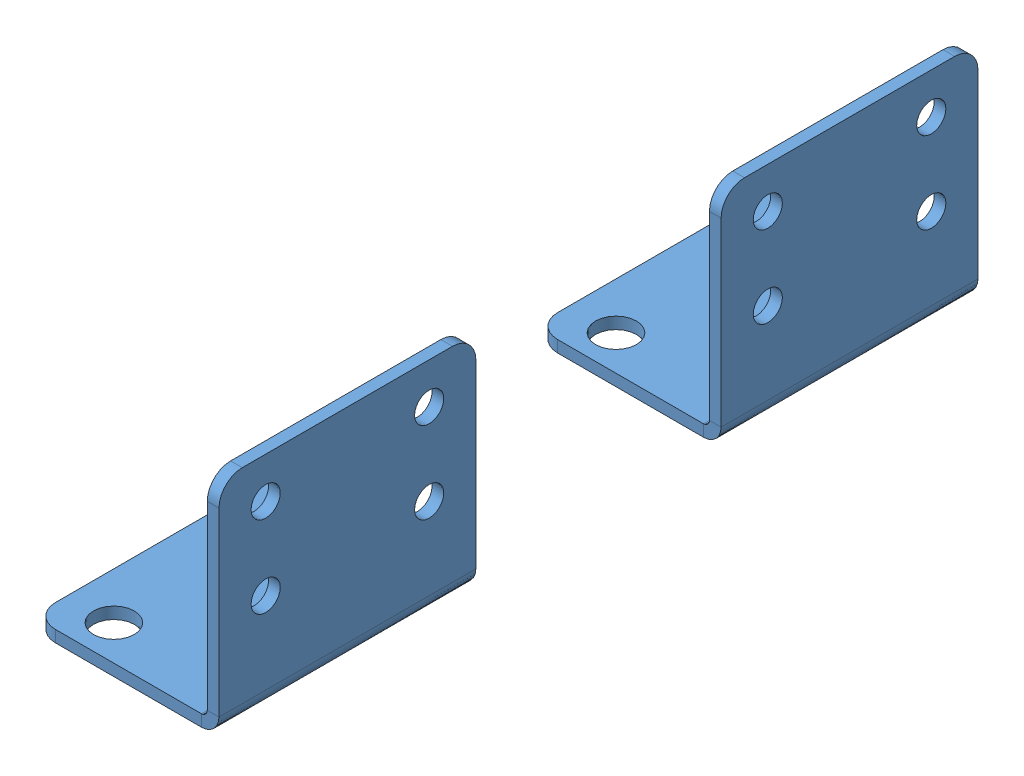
SolidWorks assembly 极限轨道与开关固定座组合.SLDASM, configuration 150 (file format 13000). Lengths in mm.
Overall size (16 19 65).
3 component instances, 2 part files, 6 mates.
Components (placement in the parent):
- SFKK60-LR 极限轨道-1: SFKK60-LR 极限轨道.SLDPRT [150] at (-2.8111 1.1304 150) (suppressed, hidden)
- 开关固定座：KK-674S2-F-1: 开关固定座：KK-674S2-F.SLDPRT [默认] at (8.1889 4.6304 154) x (0 1 0) z (0 0 1) size (19 16 22)
- 开关固定座：KK-674S2-F-2: 开关固定座：KK-674S2-F.SLDPRT [默认] at (8.1889 4.6304 111) x (0 1 0) z (0 0 1) size (19 16 22)
Mates (geometry in assembly coordinates):
- 重合1: coincident: plane of assembly; plane of SFKK60-LR 极限轨道-1 through (-6.8111 3.6304 225) normal (0 1 0); plane of 开关固定座：KK-674S2-F-1 through (-6.8111 3.6304 165) normal (0 -1 0)
- 距离1: distance = 60 mm aligned: plane of 开关固定座：KK-674S2-F-1 through (7.6889 5.1304 165) normal (0 0 1); plane of SFKK60-LR 极限轨道-1 through (-2.8111 1.1304 225) normal (0 0 1)
- 重合3: coincident: plane of assembly; plane of SFKK60-LR 极限轨道-1 through (-6.8111 -1.3696 225) normal (-1 0 0); plane of 开关固定座：KK-674S2-F-1 through (-6.8111 3.6304 165) normal (-1 0 0)
- 重合4: coincident aligned: plane of 开关固定座：KK-674S2-F-1 through (-6.8111 4.6304 165) normal (0 1 0); plane of 开关固定座：KK-674S2-F-2 through (-6.8111 4.6304 122) normal (0 1 0)
- 重合5: coincident aligned: plane of 开关固定座：KK-674S2-F-1 through (8.1889 4.6304 165) normal (-1 0 0); plane of 开关固定座：KK-674S2-F-2 through (8.1889 4.6304 122) normal (-1 0 0)
- 距离2: distance = 25 mm: plane of assembly; plane of SFKK60-LR 极限轨道-1 through (-2.8111 1.1304 75) normal (0 0 -1); plane of 开关固定座：KK-674S2-F-2 through (9.1889 5.1304 100) normal (0 0 -1)
